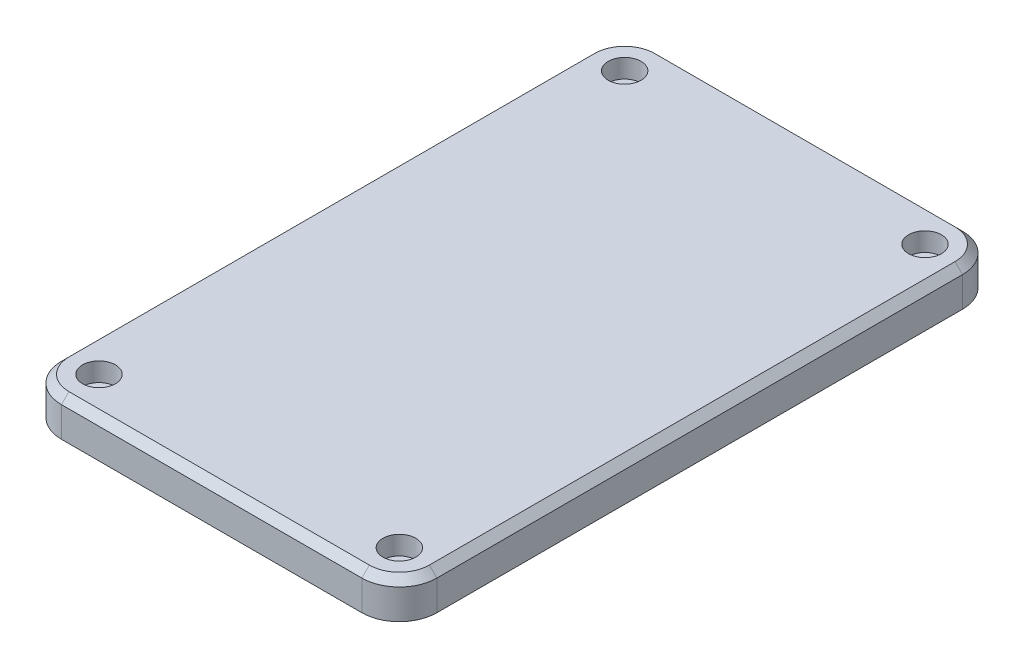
from build123d import *

# Parameters (mm, degrees)
SKETCH2_W                                        = 127
SKETCH2_H                                        = 12.7
EXTRUDE1_DEPTH                                   = 203.2
FILLET1_R                                        = 12.7
CHAMFER1_SIZE                                    = 2.54
CBORE_FOR_1_4_SOCKET_HEAD_CAP_SCREW1_D           = 6.7564
CBORE_FOR_1_4_SOCKET_HEAD_CAP_SCREW1_CBORE_D     = 11.1125
CBORE_FOR_1_4_SOCKET_HEAD_CAP_SCREW1_CBORE_DEPTH = 6.35


with BuildPart() as part:
    # Sketch2 → Extrude1 (new body)
    with BuildSketch(Plane.XY):
        with Locations((63.5, 6.35)):
            Rectangle(SKETCH2_W, SKETCH2_H)
    extrude(amount=EXTRUDE1_DEPTH)

    # Fillet1
    fillet1_edges = [part.edges().sort_by_distance(p)[0] for p in [
        (127, 6.35, 203.2),
        (0, 6.35, 203.2),
        (127, 6.35, 0),
        (0, 6.35, 0),
    ]]
    fillet(fillet1_edges, radius=FILLET1_R)

    # Chamfer1
    chamfer1_edges = [part.edges().sort_by_distance(p)[0] for p in [
        (0, 12.7, 101.6),
        (63.5, 12.7, 0),
        (63.5, 12.7, 203.2),
        (127, 12.7, 101.6),
        (3.719743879, 12.7, 199.480256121),
        (123.280256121, 12.7, 199.480256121),
        (123.280256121, 12.7, 3.719743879),
        (3.719743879, 12.7, 3.719743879),
    ]]
    chamfer(chamfer1_edges, length=CHAMFER1_SIZE)

    # CBORE for 1_4 Socket Head Cap Screw1 (through all)
    with Locations(Plane(origin=(0, 12.7, 0), x_dir=(-1, 0, 0), z_dir=(0, 1, 0))):
        with Locations((-12.7, 12.7), (-114.3, 12.7), (-114.3, 190.5), (-12.7, 190.5)):
            CounterBoreHole(CBORE_FOR_1_4_SOCKET_HEAD_CAP_SCREW1_D / 2, CBORE_FOR_1_4_SOCKET_HEAD_CAP_SCREW1_CBORE_D / 2, CBORE_FOR_1_4_SOCKET_HEAD_CAP_SCREW1_CBORE_DEPTH)


solid = part.part
